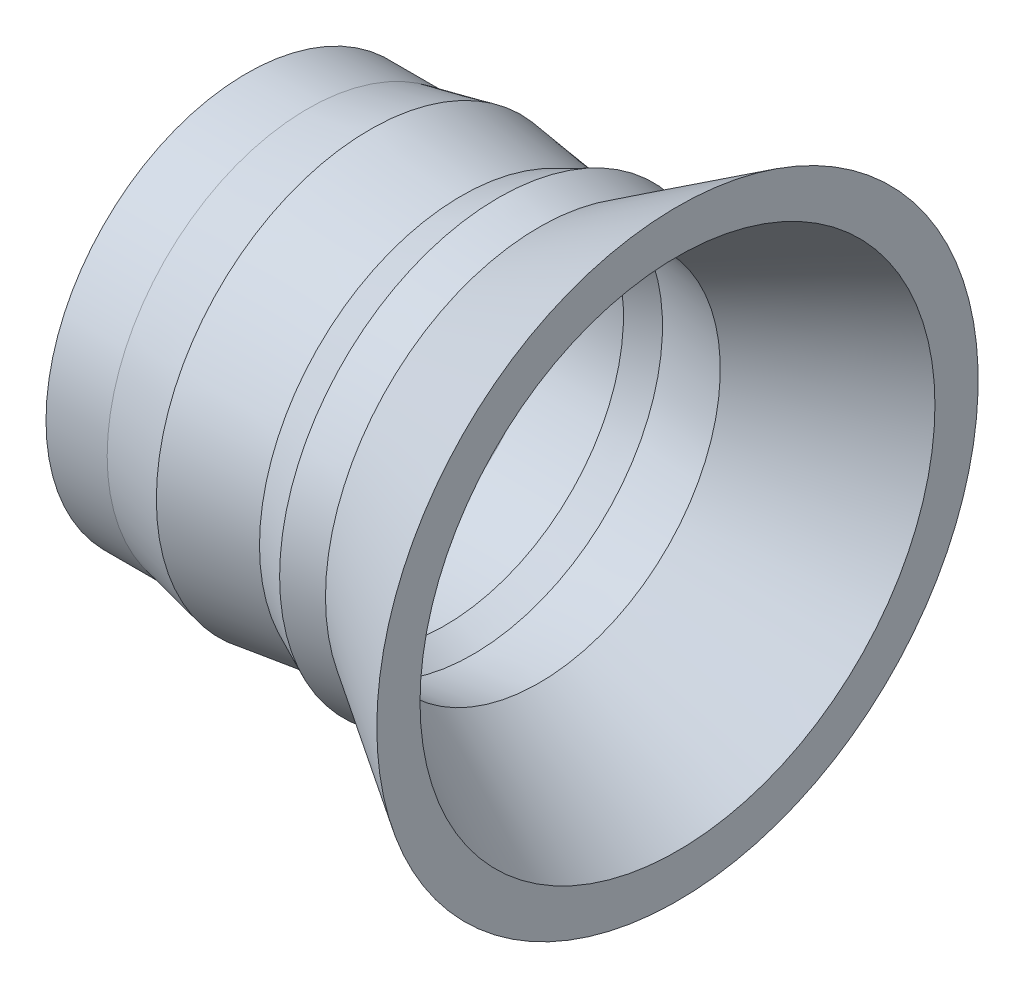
ISO-10303-21;
HEADER;
FILE_DESCRIPTION(('STEP AP214'),'2;1');
FILE_NAME('part.step','',(''),(''),'','','');
FILE_SCHEMA(('AUTOMOTIVE_DESIGN { 1 0 10303 214 1 1 1 1 }'));
ENDSEC;
DATA;
#1=APPLICATION_CONTEXT('core data for automotive mechanical design processes');
#2=APPLICATION_PROTOCOL_DEFINITION('international standard','automotive_design',2000,#1);
#3=PRODUCT_CONTEXT('',#1,'mechanical');
#4=PRODUCT('Part','Part','',(#3));
#5=PRODUCT_RELATED_PRODUCT_CATEGORY('part','',(#4));
#6=PRODUCT_DEFINITION_FORMATION('','',#4);
#7=PRODUCT_DEFINITION_CONTEXT('part definition',#1,'design');
#8=PRODUCT_DEFINITION('design','',#6,#7);
#9=PRODUCT_DEFINITION_SHAPE('','',#8);
#10=(LENGTH_UNIT() NAMED_UNIT(*) SI_UNIT(.MILLI.,.METRE.));
#11=(NAMED_UNIT(*) PLANE_ANGLE_UNIT() SI_UNIT($,.RADIAN.));
#12=(NAMED_UNIT(*) SI_UNIT($,.STERADIAN.) SOLID_ANGLE_UNIT());
#13=UNCERTAINTY_MEASURE_WITH_UNIT(LENGTH_MEASURE(1.E-05),#10,'distance_accuracy_value','');
#14=(GEOMETRIC_REPRESENTATION_CONTEXT(3) GLOBAL_UNCERTAINTY_ASSIGNED_CONTEXT((#13)) GLOBAL_UNIT_ASSIGNED_CONTEXT((#10,
#11,#12)) REPRESENTATION_CONTEXT('',''));
#15=CARTESIAN_POINT('',(0.,0.,0.));
#16=DIRECTION('',(0.,0.,1.));
#17=DIRECTION('',(1.,0.,0.));
#18=AXIS2_PLACEMENT_3D('',#15,#16,#17);
#19=CARTESIAN_POINT('',(0.,50.8,0.));
#20=DIRECTION('',(1.,0.,0.));
#21=DIRECTION('',(0.,0.,-1.));
#22=AXIS2_PLACEMENT_3D('',#19,#20,#21);
#23=PLANE('',#22);
#24=CARTESIAN_POINT('',(0.,0.,0.));
#25=DIRECTION('',(-1.,0.,0.));
#26=DIRECTION('',(0.,0.,1.));
#27=AXIS2_PLACEMENT_3D('',#24,#25,#26);
#28=CIRCLE('',#27,48.0819561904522);
#29=CARTESIAN_POINT('',(0.,0.,48.0819561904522));
#30=VERTEX_POINT('',#29);
#31=EDGE_CURVE('E10',#30,#30,#28,.T.);
#32=ORIENTED_EDGE('',*,*,#31,.F.);
#33=EDGE_LOOP('',(#32));
#34=FACE_BOUND('',#33,.T.);
#35=CARTESIAN_POINT('',(0.,0.,0.));
#36=DIRECTION('',(-1.,0.,0.));
#37=DIRECTION('',(0.,0.,1.));
#38=AXIS2_PLACEMENT_3D('',#35,#36,#37);
#39=CIRCLE('',#38,50.8);
#40=CARTESIAN_POINT('',(0.,0.,50.8));
#41=VERTEX_POINT('',#40);
#42=EDGE_CURVE('E77',#41,#41,#39,.T.);
#43=ORIENTED_EDGE('',*,*,#42,.T.);
#44=EDGE_LOOP('',(#43));
#45=FACE_BOUND('',#44,.T.);
#46=ADVANCED_FACE('F31',(#34,#45),#23,.F.);
#47=CARTESIAN_POINT('',(0.,0.,0.));
#48=DIRECTION('',(-1.,0.,0.));
#49=DIRECTION('',(0.,0.,1.));
#50=AXIS2_PLACEMENT_3D('',#47,#48,#49);
#51=CYLINDRICAL_SURFACE('',#50,48.0819561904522);
#52=CARTESIAN_POINT('',(18.1088710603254,0.,0.));
#53=DIRECTION('',(-1.,0.,0.));
#54=DIRECTION('',(0.,0.,1.));
#55=AXIS2_PLACEMENT_3D('',#52,#53,#54);
#56=CIRCLE('',#55,48.0819561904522);
#57=CARTESIAN_POINT('',(18.1088710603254,0.,48.0819561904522));
#58=VERTEX_POINT('',#57);
#59=EDGE_CURVE('E37',#58,#58,#56,.T.);
#60=ORIENTED_EDGE('',*,*,#59,.F.);
#61=EDGE_LOOP('',(#60));
#62=FACE_BOUND('',#61,.T.);
#63=ORIENTED_EDGE('',*,*,#31,.T.);
#64=EDGE_LOOP('',(#63));
#65=FACE_BOUND('',#64,.T.);
#66=ADVANCED_FACE('F150',(#62,#65),#51,.F.);
#67=CARTESIAN_POINT('',(18.1088710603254,0.,0.));
#68=DIRECTION('',(-1.,0.,0.));
#69=DIRECTION('',(0.,0.,1.));
#70=AXIS2_PLACEMENT_3D('',#67,#68,#69);
#71=CONICAL_SURFACE('',#70,48.0819561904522,0.207127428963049);
#72=CARTESIAN_POINT('',(31.2828337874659,0.,0.));
#73=DIRECTION('',(-1.,0.,0.));
#74=DIRECTION('',(0.,0.,1.));
#75=AXIS2_PLACEMENT_3D('',#72,#73,#74);
#76=CIRCLE('',#75,45.3135638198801);
#77=CARTESIAN_POINT('',(31.2828337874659,0.,45.3135638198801));
#78=VERTEX_POINT('',#77);
#79=EDGE_CURVE('E41',#78,#78,#76,.T.);
#80=ORIENTED_EDGE('',*,*,#79,.F.);
#81=EDGE_LOOP('',(#80));
#82=FACE_BOUND('',#81,.T.);
#83=ORIENTED_EDGE('',*,*,#59,.T.);
#84=EDGE_LOOP('',(#83));
#85=FACE_BOUND('',#84,.T.);
#86=ADVANCED_FACE('F145',(#82,#85),#71,.F.);
#87=CARTESIAN_POINT('',(0.,0.,0.));
#88=DIRECTION('',(-1.,0.,0.));
#89=DIRECTION('',(0.,0.,1.));
#90=AXIS2_PLACEMENT_3D('',#87,#88,#89);
#91=CYLINDRICAL_SURFACE('',#90,45.3135638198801);
#92=CARTESIAN_POINT('',(50.222222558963,0.,0.));
#93=DIRECTION('',(-1.,0.,0.));
#94=DIRECTION('',(0.,0.,1.));
#95=AXIS2_PLACEMENT_3D('',#92,#93,#94);
#96=CIRCLE('',#95,45.3135638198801);
#97=CARTESIAN_POINT('',(50.222222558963,0.,45.3135638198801));
#98=VERTEX_POINT('',#97);
#99=EDGE_CURVE('E45',#98,#98,#96,.T.);
#100=ORIENTED_EDGE('',*,*,#99,.F.);
#101=EDGE_LOOP('',(#100));
#102=FACE_BOUND('',#101,.T.);
#103=ORIENTED_EDGE('',*,*,#79,.T.);
#104=EDGE_LOOP('',(#103));
#105=FACE_BOUND('',#104,.T.);
#106=ADVANCED_FACE('F139',(#102,#105),#91,.F.);
#107=CARTESIAN_POINT('',(50.222222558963,0.,0.));
#108=DIRECTION('',(1.,0.,0.));
#109=DIRECTION('',(0.,0.,-1.));
#110=AXIS2_PLACEMENT_3D('',#107,#108,#109);
#111=CONICAL_SURFACE('',#110,45.3135638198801,0.370812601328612);
#112=CARTESIAN_POINT('',(57.3426043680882,0.,0.));
#113=DIRECTION('',(-1.,0.,0.));
#114=DIRECTION('',(0.,0.,1.));
#115=AXIS2_PLACEMENT_3D('',#112,#113,#114);
#116=CIRCLE('',#115,48.0819561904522);
#117=CARTESIAN_POINT('',(57.3426043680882,0.,48.0819561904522));
#118=VERTEX_POINT('',#117);
#119=EDGE_CURVE('E50',#118,#118,#116,.T.);
#120=ORIENTED_EDGE('',*,*,#119,.F.);
#121=EDGE_LOOP('',(#120));
#122=FACE_BOUND('',#121,.T.);
#123=ORIENTED_EDGE('',*,*,#99,.T.);
#124=EDGE_LOOP('',(#123));
#125=FACE_BOUND('',#124,.T.);
#126=ADVANCED_FACE('F133',(#122,#125),#111,.F.);
#127=CARTESIAN_POINT('',(57.3426043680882,0.,0.));
#128=DIRECTION('',(-1.,0.,0.));
#129=DIRECTION('',(0.,0.,1.));
#130=AXIS2_PLACEMENT_3D('',#127,#128,#129);
#131=CONICAL_SURFACE('',#130,48.0819561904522,0.127345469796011);
#132=CARTESIAN_POINT('',(74.1425360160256,0.,0.));
#133=DIRECTION('',(-1.,0.,0.));
#134=DIRECTION('',(0.,0.,1.));
#135=AXIS2_PLACEMENT_3D('',#132,#133,#134);
#136=CIRCLE('',#135,45.9309207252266);
#137=CARTESIAN_POINT('',(74.1425360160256,0.,45.9309207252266));
#138=VERTEX_POINT('',#137);
#139=EDGE_CURVE('E53',#138,#138,#136,.T.);
#140=ORIENTED_EDGE('',*,*,#139,.F.);
#141=EDGE_LOOP('',(#140));
#142=FACE_BOUND('',#141,.T.);
#143=ORIENTED_EDGE('',*,*,#119,.T.);
#144=EDGE_LOOP('',(#143));
#145=FACE_BOUND('',#144,.T.);
#146=ADVANCED_FACE('F127',(#142,#145),#131,.F.);
#147=CARTESIAN_POINT('',(74.1425360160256,0.,0.));
#148=DIRECTION('',(1.,0.,0.));
#149=DIRECTION('',(0.,0.,-1.));
#150=AXIS2_PLACEMENT_3D('',#147,#148,#149);
#151=CONICAL_SURFACE('',#150,45.9309207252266,0.503290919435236);
#152=CARTESIAN_POINT('',(109.223637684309,0.,0.));
#153=DIRECTION('',(-1.,0.,0.));
#154=DIRECTION('',(0.,0.,1.));
#155=AXIS2_PLACEMENT_3D('',#152,#153,#154);
#156=CIRCLE('',#155,65.245988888);
#157=CARTESIAN_POINT('',(109.223637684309,0.,65.245988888));
#158=VERTEX_POINT('',#157);
#159=EDGE_CURVE('E56',#158,#158,#156,.T.);
#160=ORIENTED_EDGE('',*,*,#159,.F.);
#161=EDGE_LOOP('',(#160));
#162=FACE_BOUND('',#161,.T.);
#163=ORIENTED_EDGE('',*,*,#139,.T.);
#164=EDGE_LOOP('',(#163));
#165=FACE_BOUND('',#164,.T.);
#166=ADVANCED_FACE('F121',(#162,#165),#151,.F.);
#167=CARTESIAN_POINT('',(109.223637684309,76.2,0.));
#168=DIRECTION('',(-1.,0.,0.));
#169=DIRECTION('',(0.,0.,1.));
#170=AXIS2_PLACEMENT_3D('',#167,#168,#169);
#171=PLANE('',#170);
#172=CARTESIAN_POINT('',(109.223637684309,0.,0.));
#173=DIRECTION('',(-1.,0.,0.));
#174=DIRECTION('',(0.,0.,1.));
#175=AXIS2_PLACEMENT_3D('',#172,#173,#174);
#176=CIRCLE('',#175,76.2);
#177=CARTESIAN_POINT('',(109.223637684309,0.,76.2));
#178=VERTEX_POINT('',#177);
#179=EDGE_CURVE('E59',#178,#178,#176,.T.);
#180=ORIENTED_EDGE('',*,*,#179,.F.);
#181=EDGE_LOOP('',(#180));
#182=FACE_BOUND('',#181,.T.);
#183=ORIENTED_EDGE('',*,*,#159,.T.);
#184=EDGE_LOOP('',(#183));
#185=FACE_BOUND('',#184,.T.);
#186=ADVANCED_FACE('F115',(#182,#185),#171,.F.);
#187=CARTESIAN_POINT('',(109.223637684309,0.,0.));
#188=DIRECTION('',(1.,0.,0.));
#189=DIRECTION('',(0.,0.,-1.));
#190=AXIS2_PLACEMENT_3D('',#187,#188,#189);
#191=CONICAL_SURFACE('',#190,76.2,0.561713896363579);
#192=CARTESIAN_POINT('',(74.1425360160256,0.,0.));
#193=DIRECTION('',(-1.,0.,0.));
#194=DIRECTION('',(0.,0.,1.));
#195=AXIS2_PLACEMENT_3D('',#192,#193,#194);
#196=CIRCLE('',#195,54.1220708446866);
#197=CARTESIAN_POINT('',(74.1425360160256,0.,54.1220708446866));
#198=VERTEX_POINT('',#197);
#199=EDGE_CURVE('E62',#198,#198,#196,.T.);
#200=ORIENTED_EDGE('',*,*,#199,.F.);
#201=EDGE_LOOP('',(#200));
#202=FACE_BOUND('',#201,.T.);
#203=ORIENTED_EDGE('',*,*,#179,.T.);
#204=EDGE_LOOP('',(#203));
#205=FACE_BOUND('',#204,.T.);
#206=ADVANCED_FACE('F109',(#202,#205),#191,.T.);
#207=CARTESIAN_POINT('',(74.1425360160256,0.,0.));
#208=DIRECTION('',(-1.,0.,0.));
#209=DIRECTION('',(0.,0.,1.));
#210=AXIS2_PLACEMENT_3D('',#207,#208,#209);
#211=CONICAL_SURFACE('',#210,54.1220708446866,0.127345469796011);
#212=CARTESIAN_POINT('',(63.837912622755,0.,0.));
#213=DIRECTION('',(-1.,0.,0.));
#214=DIRECTION('',(0.,0.,1.));
#215=AXIS2_PLACEMENT_3D('',#212,#213,#214);
#216=CIRCLE('',#215,55.4414577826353);
#217=CARTESIAN_POINT('',(63.837912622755,0.,55.4414577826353));
#218=VERTEX_POINT('',#217);
#219=EDGE_CURVE('E65',#218,#218,#216,.T.);
#220=ORIENTED_EDGE('',*,*,#219,.F.);
#221=EDGE_LOOP('',(#220));
#222=FACE_BOUND('',#221,.T.);
#223=ORIENTED_EDGE('',*,*,#199,.T.);
#224=EDGE_LOOP('',(#223));
#225=FACE_BOUND('',#224,.T.);
#226=ADVANCED_FACE('F103',(#222,#225),#211,.T.);
#227=CARTESIAN_POINT('',(63.837912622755,0.,0.));
#228=DIRECTION('',(1.,0.,0.));
#229=DIRECTION('',(0.,0.,-1.));
#230=AXIS2_PLACEMENT_3D('',#227,#228,#229);
#231=CONICAL_SURFACE('',#230,55.4414577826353,0.428486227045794);
#232=CARTESIAN_POINT('',(54.4545024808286,0.,0.));
#233=DIRECTION('',(-1.,0.,0.));
#234=DIRECTION('',(0.,0.,1.));
#235=AXIS2_PLACEMENT_3D('',#232,#233,#234);
#236=CIRCLE('',#235,51.1552087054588);
#237=CARTESIAN_POINT('',(54.4545024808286,0.,51.1552087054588));
#238=VERTEX_POINT('',#237);
#239=EDGE_CURVE('E68',#238,#238,#236,.T.);
#240=ORIENTED_EDGE('',*,*,#239,.F.);
#241=EDGE_LOOP('',(#240));
#242=FACE_BOUND('',#241,.T.);
#243=ORIENTED_EDGE('',*,*,#219,.T.);
#244=EDGE_LOOP('',(#243));
#245=FACE_BOUND('',#244,.T.);
#246=ADVANCED_FACE('F97',(#242,#245),#231,.T.);
#247=CARTESIAN_POINT('',(54.4545024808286,0.,0.));
#248=DIRECTION('',(-1.,0.,0.));
#249=DIRECTION('',(0.,0.,1.));
#250=AXIS2_PLACEMENT_3D('',#247,#248,#249);
#251=CONICAL_SURFACE('',#250,51.1552087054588,0.127345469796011);
#252=CARTESIAN_POINT('',(31.2828337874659,0.,0.));
#253=DIRECTION('',(-1.,0.,0.));
#254=DIRECTION('',(0.,0.,1.));
#255=AXIS2_PLACEMENT_3D('',#252,#253,#254);
#256=CIRCLE('',#255,54.1220708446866);
#257=CARTESIAN_POINT('',(31.2828337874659,0.,54.1220708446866));
#258=VERTEX_POINT('',#257);
#259=EDGE_CURVE('E71',#258,#258,#256,.T.);
#260=ORIENTED_EDGE('',*,*,#259,.F.);
#261=EDGE_LOOP('',(#260));
#262=FACE_BOUND('',#261,.T.);
#263=ORIENTED_EDGE('',*,*,#239,.T.);
#264=EDGE_LOOP('',(#263));
#265=FACE_BOUND('',#264,.T.);
#266=ADVANCED_FACE('F91',(#262,#265),#251,.T.);
#267=CARTESIAN_POINT('',(31.2828337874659,0.,0.));
#268=DIRECTION('',(1.,0.,0.));
#269=DIRECTION('',(0.,0.,-1.));
#270=AXIS2_PLACEMENT_3D('',#267,#268,#269);
#271=CONICAL_SURFACE('',#270,54.1220708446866,0.207496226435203);
#272=CARTESIAN_POINT('',(15.5029972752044,0.,0.));
#273=DIRECTION('',(-1.,0.,0.));
#274=DIRECTION('',(0.,0.,1.));
#275=AXIS2_PLACEMENT_3D('',#272,#273,#274);
#276=CIRCLE('',#275,50.8);
#277=CARTESIAN_POINT('',(15.5029972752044,0.,50.8));
#278=VERTEX_POINT('',#277);
#279=EDGE_CURVE('E74',#278,#278,#276,.T.);
#280=ORIENTED_EDGE('',*,*,#279,.F.);
#281=EDGE_LOOP('',(#280));
#282=FACE_BOUND('',#281,.T.);
#283=ORIENTED_EDGE('',*,*,#259,.T.);
#284=EDGE_LOOP('',(#283));
#285=FACE_BOUND('',#284,.T.);
#286=ADVANCED_FACE('F85',(#282,#285),#271,.T.);
#287=CARTESIAN_POINT('',(0.,0.,0.));
#288=DIRECTION('',(-1.,0.,0.));
#289=DIRECTION('',(0.,0.,1.));
#290=AXIS2_PLACEMENT_3D('',#287,#288,#289);
#291=CYLINDRICAL_SURFACE('',#290,50.8);
#292=ORIENTED_EDGE('',*,*,#42,.F.);
#293=EDGE_LOOP('',(#292));
#294=FACE_BOUND('',#293,.T.);
#295=ORIENTED_EDGE('',*,*,#279,.T.);
#296=EDGE_LOOP('',(#295));
#297=FACE_BOUND('',#296,.T.);
#298=ADVANCED_FACE('F82',(#294,#297),#291,.T.);
#299=CLOSED_SHELL('',(#46,#66,#86,#106,#126,#146,#166,#186,#206,#226,#246,#266,#286,#298));
#300=MANIFOLD_SOLID_BREP('B2',#299);
#301=ADVANCED_BREP_SHAPE_REPRESENTATION('',(#18,#300),#14);
#302=SHAPE_DEFINITION_REPRESENTATION(#9,#301);
ENDSEC;
END-ISO-10303-21;
